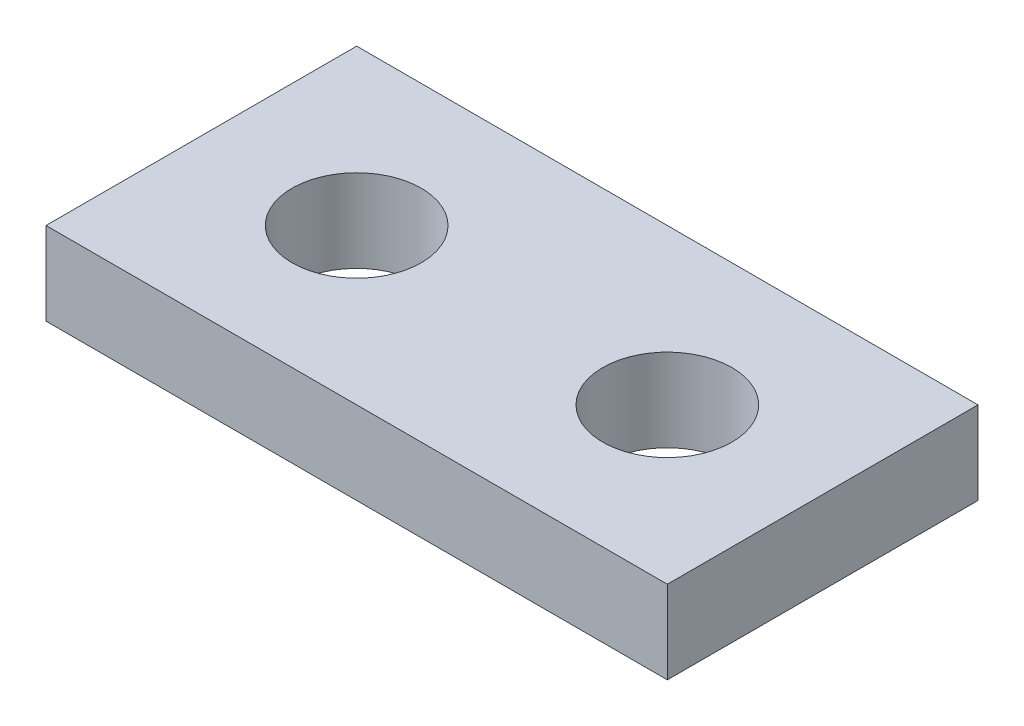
from build123d import *

# Parameters (mm, degrees)
SKETCH1_W           = 19.05
SKETCH1_H           = 9.525
SKETCH1_R           = 1.9812
BOSS_EXTRUDE1_DEPTH = 2.54


with BuildPart() as part:
    # Sketch1 → Boss-Extrude1 (new body)
    with BuildSketch(Plane(origin=(0, 0, 0), x_dir=(1, 0, 0), z_dir=(0, 1, 0))):
        Rectangle(SKETCH1_W, SKETCH1_H)
        with Locations(Location((-4.7625, 0, 0), (0, 0, 270))):
            Circle(SKETCH1_R, mode=Mode.SUBTRACT)
        with Locations(Location((4.7625, 0, 0), (0, 0, 90))):
            Circle(SKETCH1_R, mode=Mode.SUBTRACT)
    extrude(amount=BOSS_EXTRUDE1_DEPTH)


solid = part.part
